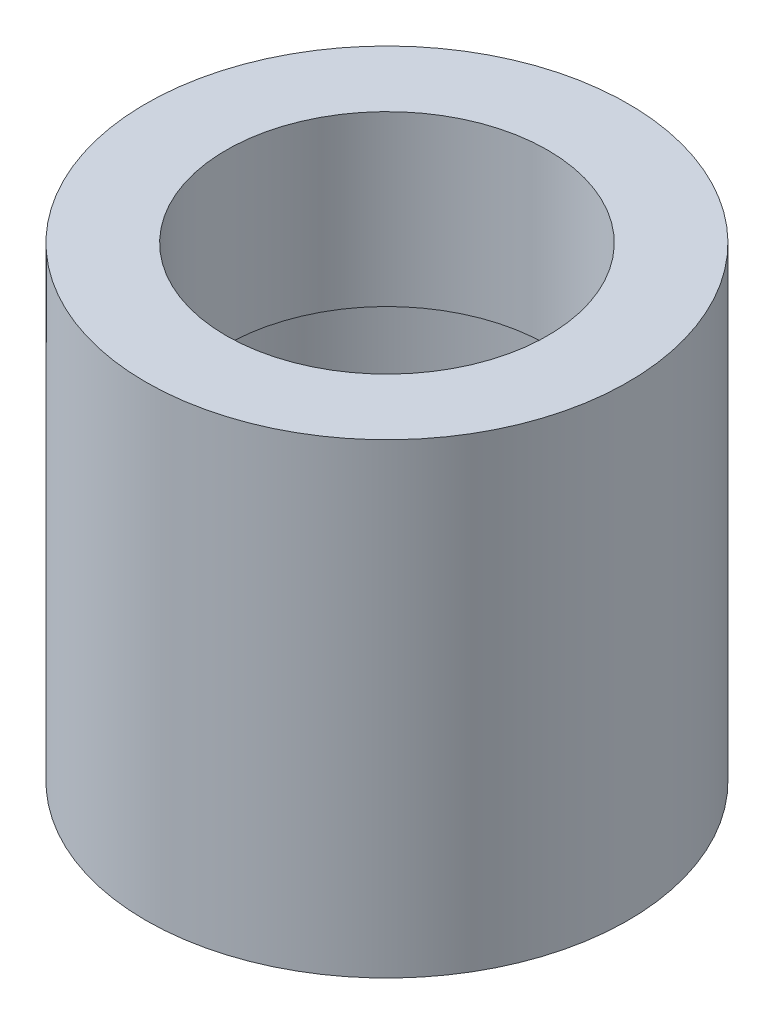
ISO-10303-21;
HEADER;
FILE_DESCRIPTION(('STEP AP214'),'2;1');
FILE_NAME('part.step','',(''),(''),'','','');
FILE_SCHEMA(('AUTOMOTIVE_DESIGN { 1 0 10303 214 1 1 1 1 }'));
ENDSEC;
DATA;
#1=APPLICATION_CONTEXT('core data for automotive mechanical design processes');
#2=APPLICATION_PROTOCOL_DEFINITION('international standard','automotive_design',2000,#1);
#3=PRODUCT_CONTEXT('',#1,'mechanical');
#4=PRODUCT('Part','Part','',(#3));
#5=PRODUCT_RELATED_PRODUCT_CATEGORY('part','',(#4));
#6=PRODUCT_DEFINITION_FORMATION('','',#4);
#7=PRODUCT_DEFINITION_CONTEXT('part definition',#1,'design');
#8=PRODUCT_DEFINITION('design','',#6,#7);
#9=PRODUCT_DEFINITION_SHAPE('','',#8);
#10=(LENGTH_UNIT() NAMED_UNIT(*) SI_UNIT(.MILLI.,.METRE.));
#11=(NAMED_UNIT(*) PLANE_ANGLE_UNIT() SI_UNIT($,.RADIAN.));
#12=(NAMED_UNIT(*) SI_UNIT($,.STERADIAN.) SOLID_ANGLE_UNIT());
#13=UNCERTAINTY_MEASURE_WITH_UNIT(LENGTH_MEASURE(1.E-05),#10,'distance_accuracy_value','');
#14=(GEOMETRIC_REPRESENTATION_CONTEXT(3) GLOBAL_UNCERTAINTY_ASSIGNED_CONTEXT((#13)) GLOBAL_UNIT_ASSIGNED_CONTEXT((#10,
#11,#12)) REPRESENTATION_CONTEXT('',''));
#15=CARTESIAN_POINT('',(0.,0.,0.));
#16=DIRECTION('',(0.,0.,1.));
#17=DIRECTION('',(1.,0.,0.));
#18=AXIS2_PLACEMENT_3D('',#15,#16,#17);
#19=CARTESIAN_POINT('',(0.,-14.5,0.));
#20=DIRECTION('',(0.,1.,0.));
#21=DIRECTION('',(0.,0.,1.));
#22=AXIS2_PLACEMENT_3D('',#19,#20,#21);
#23=CYLINDRICAL_SURFACE('',#22,13.);
#24=CARTESIAN_POINT('',(0.,-14.5,0.));
#25=DIRECTION('',(0.,1.,0.));
#26=DIRECTION('',(0.,0.,1.));
#27=AXIS2_PLACEMENT_3D('',#24,#25,#26);
#28=CIRCLE('',#27,13.);
#29=CARTESIAN_POINT('',(0.,-14.5,13.));
#30=VERTEX_POINT('',#29);
#31=EDGE_CURVE('E62',#30,#30,#28,.T.);
#32=CARTESIAN_POINT('',(0.,4.,0.));
#33=DIRECTION('',(0.,1.,0.));
#34=DIRECTION('',(0.,0.,1.));
#35=AXIS2_PLACEMENT_3D('',#32,#33,#34);
#36=CIRCLE('',#35,13.);
#37=CARTESIAN_POINT('',(0.,4.,13.));
#38=VERTEX_POINT('',#37);
#39=EDGE_CURVE('E10',#38,#38,#36,.F.);
#40=CARTESIAN_POINT('',(0.,-14.5,13.));
#41=CARTESIAN_POINT('',(0.,-14.3072916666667,13.));
#42=CARTESIAN_POINT('',(0.,-14.1145833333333,13.));
#43=CARTESIAN_POINT('',(0.,-13.7291666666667,13.));
#44=CARTESIAN_POINT('',(0.,-13.5364583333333,13.));
#45=CARTESIAN_POINT('',(0.,-13.1510416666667,13.));
#46=CARTESIAN_POINT('',(0.,-12.9583333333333,13.));
#47=CARTESIAN_POINT('',(0.,-12.5729166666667,13.));
#48=CARTESIAN_POINT('',(0.,-12.3802083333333,13.));
#49=CARTESIAN_POINT('',(0.,-11.9947916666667,13.));
#50=CARTESIAN_POINT('',(0.,-11.8020833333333,13.));
#51=CARTESIAN_POINT('',(0.,-11.4166666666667,13.));
#52=CARTESIAN_POINT('',(0.,-11.2239583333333,13.));
#53=CARTESIAN_POINT('',(0.,-10.8385416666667,13.));
#54=CARTESIAN_POINT('',(0.,-10.6458333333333,13.));
#55=CARTESIAN_POINT('',(0.,-10.2604166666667,13.));
#56=CARTESIAN_POINT('',(0.,-10.0677083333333,13.));
#57=CARTESIAN_POINT('',(0.,-9.68229166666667,13.));
#58=CARTESIAN_POINT('',(0.,-9.48958333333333,13.));
#59=CARTESIAN_POINT('',(0.,-9.10416666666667,13.));
#60=CARTESIAN_POINT('',(0.,-8.91145833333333,13.));
#61=CARTESIAN_POINT('',(0.,-8.52604166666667,13.));
#62=CARTESIAN_POINT('',(0.,-8.33333333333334,13.));
#63=CARTESIAN_POINT('',(0.,-7.94791666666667,13.));
#64=CARTESIAN_POINT('',(0.,-7.75520833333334,13.));
#65=CARTESIAN_POINT('',(0.,-7.36979166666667,13.));
#66=CARTESIAN_POINT('',(0.,-7.17708333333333,13.));
#67=CARTESIAN_POINT('',(0.,-6.79166666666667,13.));
#68=CARTESIAN_POINT('',(0.,-6.59895833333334,13.));
#69=CARTESIAN_POINT('',(0.,-6.21354166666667,13.));
#70=CARTESIAN_POINT('',(0.,-6.02083333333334,13.));
#71=CARTESIAN_POINT('',(0.,-5.63541666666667,13.));
#72=CARTESIAN_POINT('',(0.,-5.44270833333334,13.));
#73=CARTESIAN_POINT('',(0.,-5.05729166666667,13.));
#74=CARTESIAN_POINT('',(0.,-4.86458333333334,13.));
#75=CARTESIAN_POINT('',(0.,-4.47916666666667,13.));
#76=CARTESIAN_POINT('',(0.,-4.28645833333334,13.));
#77=CARTESIAN_POINT('',(0.,-3.90104166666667,13.));
#78=CARTESIAN_POINT('',(0.,-3.70833333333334,13.));
#79=CARTESIAN_POINT('',(0.,-3.32291666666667,13.));
#80=CARTESIAN_POINT('',(0.,-3.13020833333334,13.));
#81=CARTESIAN_POINT('',(0.,-2.74479166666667,13.));
#82=CARTESIAN_POINT('',(0.,-2.55208333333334,13.));
#83=CARTESIAN_POINT('',(0.,-2.16666666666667,13.));
#84=CARTESIAN_POINT('',(0.,-1.97395833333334,13.));
#85=CARTESIAN_POINT('',(0.,-1.58854166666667,13.));
#86=CARTESIAN_POINT('',(0.,-1.39583333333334,13.));
#87=CARTESIAN_POINT('',(0.,-1.01041666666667,13.));
#88=CARTESIAN_POINT('',(0.,-0.817708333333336,13.));
#89=CARTESIAN_POINT('',(0.,-0.432291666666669,13.));
#90=CARTESIAN_POINT('',(0.,-0.239583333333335,13.));
#91=CARTESIAN_POINT('',(0.,0.145833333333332,13.));
#92=CARTESIAN_POINT('',(0.,0.338541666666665,13.));
#93=CARTESIAN_POINT('',(0.,0.723958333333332,13.));
#94=CARTESIAN_POINT('',(0.,0.916666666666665,13.));
#95=CARTESIAN_POINT('',(0.,1.30208333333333,13.));
#96=CARTESIAN_POINT('',(0.,1.49479166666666,13.));
#97=CARTESIAN_POINT('',(0.,1.88020833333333,13.));
#98=CARTESIAN_POINT('',(0.,2.07291666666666,13.));
#99=CARTESIAN_POINT('',(0.,2.45833333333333,13.));
#100=CARTESIAN_POINT('',(0.,2.65104166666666,13.));
#101=CARTESIAN_POINT('',(0.,3.03645833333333,13.));
#102=CARTESIAN_POINT('',(0.,3.22916666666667,13.));
#103=CARTESIAN_POINT('',(0.,3.61458333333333,13.));
#104=CARTESIAN_POINT('',(0.,3.80729166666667,13.));
#105=CARTESIAN_POINT('',(0.,4.,13.));
#106=B_SPLINE_CURVE_WITH_KNOTS('',3,(#40,#41,#42,#43,#44,#45,#46,#47,#48,#49,#50,#51,#52,#53,
#54,#55,#56,#57,#58,#59,#60,#61,#62,#63,#64,#65,#66,#67,#68,#69,#70,#71,#72,#73,#74,#75,#76,#77,
#78,#79,#80,#81,#82,#83,#84,#85,#86,#87,#88,#89,#90,#91,#92,#93,#94,#95,#96,#97,#98,#99,#100,
#101,#102,#103,#104,#105),.UNSPECIFIED.,.F.,.F.,(4,2,2,2,2,2,2,2,2,2,2,2,2,2,2,2,2,2,2,2,2,2,2,
2,2,2,2,2,2,2,2,2,4),(0.,0.578125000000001,1.15625,1.734375,2.3125,2.890625,3.46875,4.046875,
4.625,5.203125,5.78125,6.359375,6.9375,7.515625,8.09375,8.671875,9.25,9.828125,10.40625,
10.984375,11.5625,12.140625,12.71875,13.296875,13.875,14.453125,15.03125,15.609375,16.1875,
16.765625,17.34375,17.921875,18.5),.UNSPECIFIED.);
#107=EDGE_CURVE('BSEAM43',#30,#38,#106,.T.);
#108=ORIENTED_EDGE('',*,*,#31,.F.);
#109=ORIENTED_EDGE('',*,*,#39,.F.);
#110=ORIENTED_EDGE('',*,*,#107,.T.);
#111=ORIENTED_EDGE('',*,*,#107,.F.);
#112=EDGE_LOOP('',(#108,#110,#109,#111));
#113=FACE_BOUND('',#112,.T.);
#114=ADVANCED_FACE('F43',(#113),#23,.F.);
#115=CARTESIAN_POINT('',(0.,-14.5,0.));
#116=DIRECTION('',(0.,1.,0.));
#117=DIRECTION('',(0.,0.,1.));
#118=AXIS2_PLACEMENT_3D('',#115,#116,#117);
#119=CYLINDRICAL_SURFACE('',#118,15.);
#120=CARTESIAN_POINT('',(0.,-14.5,0.));
#121=DIRECTION('',(0.,1.,0.));
#122=DIRECTION('',(0.,0.,1.));
#123=AXIS2_PLACEMENT_3D('',#120,#121,#122);
#124=CIRCLE('',#123,15.);
#125=CARTESIAN_POINT('',(0.,-14.5,15.));
#126=VERTEX_POINT('',#125);
#127=EDGE_CURVE('E51',#126,#126,#124,.T.);
#128=CARTESIAN_POINT('',(0.,14.5,0.));
#129=DIRECTION('',(0.,1.,0.));
#130=DIRECTION('',(0.,0.,1.));
#131=AXIS2_PLACEMENT_3D('',#128,#129,#130);
#132=CIRCLE('',#131,15.);
#133=CARTESIAN_POINT('',(0.,14.5,15.));
#134=VERTEX_POINT('',#133);
#135=EDGE_CURVE('E56',#134,#134,#132,.T.);
#136=CARTESIAN_POINT('',(0.,-14.5,15.));
#137=CARTESIAN_POINT('',(0.,-14.1979166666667,15.));
#138=CARTESIAN_POINT('',(0.,-13.8958333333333,15.));
#139=CARTESIAN_POINT('',(0.,-13.2916666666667,15.));
#140=CARTESIAN_POINT('',(0.,-12.9895833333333,15.));
#141=CARTESIAN_POINT('',(0.,-12.3854166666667,15.));
#142=CARTESIAN_POINT('',(0.,-12.0833333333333,15.));
#143=CARTESIAN_POINT('',(0.,-11.4791666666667,15.));
#144=CARTESIAN_POINT('',(0.,-11.1770833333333,15.));
#145=CARTESIAN_POINT('',(0.,-10.5729166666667,15.));
#146=CARTESIAN_POINT('',(0.,-10.2708333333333,15.));
#147=CARTESIAN_POINT('',(0.,-9.66666666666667,15.));
#148=CARTESIAN_POINT('',(0.,-9.36458333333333,15.));
#149=CARTESIAN_POINT('',(0.,-8.76041666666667,15.));
#150=CARTESIAN_POINT('',(0.,-8.45833333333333,15.));
#151=CARTESIAN_POINT('',(0.,-7.85416666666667,15.));
#152=CARTESIAN_POINT('',(0.,-7.55208333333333,15.));
#153=CARTESIAN_POINT('',(0.,-6.94791666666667,15.));
#154=CARTESIAN_POINT('',(0.,-6.64583333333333,15.));
#155=CARTESIAN_POINT('',(0.,-6.04166666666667,15.));
#156=CARTESIAN_POINT('',(0.,-5.73958333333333,15.));
#157=CARTESIAN_POINT('',(0.,-5.13541666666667,15.));
#158=CARTESIAN_POINT('',(0.,-4.83333333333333,15.));
#159=CARTESIAN_POINT('',(0.,-4.22916666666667,15.));
#160=CARTESIAN_POINT('',(0.,-3.92708333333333,15.));
#161=CARTESIAN_POINT('',(0.,-3.32291666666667,15.));
#162=CARTESIAN_POINT('',(0.,-3.02083333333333,15.));
#163=CARTESIAN_POINT('',(0.,-2.41666666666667,15.));
#164=CARTESIAN_POINT('',(0.,-2.11458333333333,15.));
#165=CARTESIAN_POINT('',(0.,-1.51041666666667,15.));
#166=CARTESIAN_POINT('',(0.,-1.20833333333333,15.));
#167=CARTESIAN_POINT('',(0.,-0.604166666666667,15.));
#168=CARTESIAN_POINT('',(0.,-0.302083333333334,15.));
#169=CARTESIAN_POINT('',(0.,0.302083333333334,15.));
#170=CARTESIAN_POINT('',(0.,0.604166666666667,15.));
#171=CARTESIAN_POINT('',(0.,1.20833333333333,15.));
#172=CARTESIAN_POINT('',(0.,1.51041666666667,15.));
#173=CARTESIAN_POINT('',(0.,2.11458333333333,15.));
#174=CARTESIAN_POINT('',(0.,2.41666666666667,15.));
#175=CARTESIAN_POINT('',(0.,3.02083333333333,15.));
#176=CARTESIAN_POINT('',(0.,3.32291666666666,15.));
#177=CARTESIAN_POINT('',(0.,3.92708333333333,15.));
#178=CARTESIAN_POINT('',(0.,4.22916666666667,15.));
#179=CARTESIAN_POINT('',(0.,4.83333333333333,15.));
#180=CARTESIAN_POINT('',(0.,5.13541666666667,15.));
#181=CARTESIAN_POINT('',(0.,5.73958333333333,15.));
#182=CARTESIAN_POINT('',(0.,6.04166666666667,15.));
#183=CARTESIAN_POINT('',(0.,6.64583333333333,15.));
#184=CARTESIAN_POINT('',(0.,6.94791666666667,15.));
#185=CARTESIAN_POINT('',(0.,7.55208333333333,15.));
#186=CARTESIAN_POINT('',(0.,7.85416666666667,15.));
#187=CARTESIAN_POINT('',(0.,8.45833333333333,15.));
#188=CARTESIAN_POINT('',(0.,8.76041666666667,15.));
#189=CARTESIAN_POINT('',(0.,9.36458333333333,15.));
#190=CARTESIAN_POINT('',(0.,9.66666666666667,15.));
#191=CARTESIAN_POINT('',(0.,10.2708333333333,15.));
#192=CARTESIAN_POINT('',(0.,10.5729166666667,15.));
#193=CARTESIAN_POINT('',(0.,11.1770833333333,15.));
#194=CARTESIAN_POINT('',(0.,11.4791666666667,15.));
#195=CARTESIAN_POINT('',(0.,12.0833333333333,15.));
#196=CARTESIAN_POINT('',(0.,12.3854166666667,15.));
#197=CARTESIAN_POINT('',(0.,12.9895833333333,15.));
#198=CARTESIAN_POINT('',(0.,13.2916666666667,15.));
#199=CARTESIAN_POINT('',(0.,13.8958333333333,15.));
#200=CARTESIAN_POINT('',(0.,14.1979166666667,15.));
#201=CARTESIAN_POINT('',(0.,14.5,15.));
#202=B_SPLINE_CURVE_WITH_KNOTS('',3,(#136,#137,#138,#139,#140,#141,#142,#143,#144,#145,#146,
#147,#148,#149,#150,#151,#152,#153,#154,#155,#156,#157,#158,#159,#160,#161,#162,#163,#164,#165,
#166,#167,#168,#169,#170,#171,#172,#173,#174,#175,#176,#177,#178,#179,#180,#181,#182,#183,#184,
#185,#186,#187,#188,#189,#190,#191,#192,#193,#194,#195,#196,#197,#198,#199,#200,#201),
.UNSPECIFIED.,.F.,.F.,(4,2,2,2,2,2,2,2,2,2,2,2,2,2,2,2,2,2,2,2,2,2,2,2,2,2,2,2,2,2,2,2,4),(0.,
0.906249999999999,1.8125,2.71875,3.625,4.53125,5.4375,6.34375,7.25,8.15625,9.0625,9.96875,
10.875,11.78125,12.6875,13.59375,14.5,15.40625,16.3125,17.21875,18.125,19.03125,19.9375,
20.84375,21.75,22.65625,23.5625,24.46875,25.375,26.28125,27.1875,28.09375,29.),.UNSPECIFIED.);
#203=EDGE_CURVE('BSEAM45',#126,#134,#202,.T.);
#204=ORIENTED_EDGE('',*,*,#127,.T.);
#205=ORIENTED_EDGE('',*,*,#135,.F.);
#206=ORIENTED_EDGE('',*,*,#203,.T.);
#207=ORIENTED_EDGE('',*,*,#203,.F.);
#208=EDGE_LOOP('',(#204,#206,#205,#207));
#209=FACE_BOUND('',#208,.T.);
#210=ADVANCED_FACE('F45',(#209),#119,.T.);
#211=CARTESIAN_POINT('',(0.,-14.5,0.));
#212=DIRECTION('',(0.,1.,0.));
#213=DIRECTION('',(0.,0.,1.));
#214=AXIS2_PLACEMENT_3D('',#211,#212,#213);
#215=PLANE('',#214);
#216=ORIENTED_EDGE('',*,*,#31,.T.);
#217=EDGE_LOOP('',(#216));
#218=FACE_BOUND('',#217,.T.);
#219=ORIENTED_EDGE('',*,*,#127,.F.);
#220=EDGE_LOOP('',(#219));
#221=FACE_BOUND('',#220,.T.);
#222=ADVANCED_FACE('F86',(#218,#221),#215,.F.);
#223=CARTESIAN_POINT('',(0.,14.5,0.));
#224=DIRECTION('',(0.,1.,0.));
#225=DIRECTION('',(0.,0.,1.));
#226=AXIS2_PLACEMENT_3D('',#223,#224,#225);
#227=PLANE('',#226);
#228=ORIENTED_EDGE('',*,*,#135,.T.);
#229=EDGE_LOOP('',(#228));
#230=FACE_BOUND('',#229,.T.);
#231=CARTESIAN_POINT('',(0.,14.5,0.));
#232=DIRECTION('',(0.,1.,0.));
#233=DIRECTION('',(0.,0.,1.));
#234=AXIS2_PLACEMENT_3D('',#231,#232,#233);
#235=CIRCLE('',#234,10.);
#236=CARTESIAN_POINT('',(0.,14.5,10.));
#237=VERTEX_POINT('',#236);
#238=EDGE_CURVE('E68',#237,#237,#235,.T.);
#239=ORIENTED_EDGE('',*,*,#238,.F.);
#240=EDGE_LOOP('',(#239));
#241=FACE_BOUND('',#240,.T.);
#242=ADVANCED_FACE('F84',(#230,#241),#227,.T.);
#243=CARTESIAN_POINT('',(0.,4.,0.));
#244=DIRECTION('',(0.,1.,0.));
#245=DIRECTION('',(0.,0.,1.));
#246=AXIS2_PLACEMENT_3D('',#243,#244,#245);
#247=PLANE('',#246);
#248=CARTESIAN_POINT('',(0.,4.,0.));
#249=DIRECTION('',(0.,1.,0.));
#250=DIRECTION('',(0.,0.,1.));
#251=AXIS2_PLACEMENT_3D('',#248,#249,#250);
#252=CIRCLE('',#251,10.);
#253=CARTESIAN_POINT('',(0.,4.,10.));
#254=VERTEX_POINT('',#253);
#255=EDGE_CURVE('E67',#254,#254,#252,.T.);
#256=ORIENTED_EDGE('',*,*,#255,.T.);
#257=EDGE_LOOP('',(#256));
#258=FACE_BOUND('',#257,.T.);
#259=ORIENTED_EDGE('',*,*,#39,.T.);
#260=EDGE_LOOP('',(#259));
#261=FACE_BOUND('',#260,.T.);
#262=ADVANCED_FACE('F76',(#258,#261),#247,.F.);
#263=CARTESIAN_POINT('',(0.,4.,0.));
#264=DIRECTION('',(0.,1.,0.));
#265=DIRECTION('',(0.,0.,1.));
#266=AXIS2_PLACEMENT_3D('',#263,#264,#265);
#267=CYLINDRICAL_SURFACE('',#266,10.);
#268=CARTESIAN_POINT('',(0.,4.,10.));
#269=CARTESIAN_POINT('',(0.,4.109375,10.));
#270=CARTESIAN_POINT('',(0.,4.21875,10.));
#271=CARTESIAN_POINT('',(0.,4.4375,10.));
#272=CARTESIAN_POINT('',(0.,4.546875,10.));
#273=CARTESIAN_POINT('',(0.,4.765625,10.));
#274=CARTESIAN_POINT('',(0.,4.875,10.));
#275=CARTESIAN_POINT('',(0.,5.09375,10.));
#276=CARTESIAN_POINT('',(0.,5.203125,10.));
#277=CARTESIAN_POINT('',(0.,5.421875,10.));
#278=CARTESIAN_POINT('',(0.,5.53125,10.));
#279=CARTESIAN_POINT('',(0.,5.75,10.));
#280=CARTESIAN_POINT('',(0.,5.859375,10.));
#281=CARTESIAN_POINT('',(0.,6.078125,10.));
#282=CARTESIAN_POINT('',(0.,6.1875,10.));
#283=CARTESIAN_POINT('',(0.,6.40625,10.));
#284=CARTESIAN_POINT('',(0.,6.515625,10.));
#285=CARTESIAN_POINT('',(0.,6.734375,10.));
#286=CARTESIAN_POINT('',(0.,6.84375,10.));
#287=CARTESIAN_POINT('',(0.,7.0625,10.));
#288=CARTESIAN_POINT('',(0.,7.171875,10.));
#289=CARTESIAN_POINT('',(0.,7.390625,10.));
#290=CARTESIAN_POINT('',(0.,7.5,10.));
#291=CARTESIAN_POINT('',(0.,7.71875,10.));
#292=CARTESIAN_POINT('',(0.,7.828125,10.));
#293=CARTESIAN_POINT('',(0.,8.046875,10.));
#294=CARTESIAN_POINT('',(0.,8.15625,10.));
#295=CARTESIAN_POINT('',(0.,8.375,10.));
#296=CARTESIAN_POINT('',(0.,8.484375,10.));
#297=CARTESIAN_POINT('',(0.,8.703125,10.));
#298=CARTESIAN_POINT('',(0.,8.8125,10.));
#299=CARTESIAN_POINT('',(0.,9.03125,10.));
#300=CARTESIAN_POINT('',(0.,9.140625,10.));
#301=CARTESIAN_POINT('',(0.,9.359375,10.));
#302=CARTESIAN_POINT('',(0.,9.46875,10.));
#303=CARTESIAN_POINT('',(0.,9.6875,10.));
#304=CARTESIAN_POINT('',(0.,9.796875,10.));
#305=CARTESIAN_POINT('',(0.,10.015625,10.));
#306=CARTESIAN_POINT('',(0.,10.125,10.));
#307=CARTESIAN_POINT('',(0.,10.34375,10.));
#308=CARTESIAN_POINT('',(0.,10.453125,10.));
#309=CARTESIAN_POINT('',(0.,10.671875,10.));
#310=CARTESIAN_POINT('',(0.,10.78125,10.));
#311=CARTESIAN_POINT('',(0.,11.,10.));
#312=CARTESIAN_POINT('',(0.,11.109375,10.));
#313=CARTESIAN_POINT('',(0.,11.328125,10.));
#314=CARTESIAN_POINT('',(0.,11.4375,10.));
#315=CARTESIAN_POINT('',(0.,11.65625,10.));
#316=CARTESIAN_POINT('',(0.,11.765625,10.));
#317=CARTESIAN_POINT('',(0.,11.984375,10.));
#318=CARTESIAN_POINT('',(0.,12.09375,10.));
#319=CARTESIAN_POINT('',(0.,12.3125,10.));
#320=CARTESIAN_POINT('',(0.,12.421875,10.));
#321=CARTESIAN_POINT('',(0.,12.640625,10.));
#322=CARTESIAN_POINT('',(0.,12.75,10.));
#323=CARTESIAN_POINT('',(0.,12.96875,10.));
#324=CARTESIAN_POINT('',(0.,13.078125,10.));
#325=CARTESIAN_POINT('',(0.,13.296875,10.));
#326=CARTESIAN_POINT('',(0.,13.40625,10.));
#327=CARTESIAN_POINT('',(0.,13.625,10.));
#328=CARTESIAN_POINT('',(0.,13.734375,10.));
#329=CARTESIAN_POINT('',(0.,13.953125,10.));
#330=CARTESIAN_POINT('',(0.,14.0625,10.));
#331=CARTESIAN_POINT('',(0.,14.28125,10.));
#332=CARTESIAN_POINT('',(0.,14.390625,10.));
#333=CARTESIAN_POINT('',(0.,14.5,10.));
#334=B_SPLINE_CURVE_WITH_KNOTS('',3,(#268,#269,#270,#271,#272,#273,#274,#275,#276,#277,#278,
#279,#280,#281,#282,#283,#284,#285,#286,#287,#288,#289,#290,#291,#292,#293,#294,#295,#296,#297,
#298,#299,#300,#301,#302,#303,#304,#305,#306,#307,#308,#309,#310,#311,#312,#313,#314,#315,#316,
#317,#318,#319,#320,#321,#322,#323,#324,#325,#326,#327,#328,#329,#330,#331,#332,#333),
.UNSPECIFIED.,.F.,.F.,(4,2,2,2,2,2,2,2,2,2,2,2,2,2,2,2,2,2,2,2,2,2,2,2,2,2,2,2,2,2,2,2,4),(0.,
0.328125,0.656250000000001,0.984375,1.3125,1.640625,1.96875,2.296875,2.625,2.953125,3.28125,
3.609375,3.9375,4.265625,4.59375,4.921875,5.25,5.578125,5.90625,6.234375,6.5625,6.890625,
7.21875,7.546875,7.875,8.203125,8.53125,8.859375,9.1875,9.515625,9.84375,10.171875,10.5),.UNSPECIFIED.);
#335=EDGE_CURVE('BSEAM78',#254,#237,#334,.T.);
#336=ORIENTED_EDGE('',*,*,#255,.F.);
#337=ORIENTED_EDGE('',*,*,#238,.T.);
#338=ORIENTED_EDGE('',*,*,#335,.T.);
#339=ORIENTED_EDGE('',*,*,#335,.F.);
#340=EDGE_LOOP('',(#336,#338,#337,#339));
#341=FACE_BOUND('',#340,.T.);
#342=ADVANCED_FACE('F78',(#341),#267,.F.);
#343=CLOSED_SHELL('',(#114,#210,#222,#242,#262,#342));
#344=MANIFOLD_SOLID_BREP('B2',#343);
#345=ADVANCED_BREP_SHAPE_REPRESENTATION('',(#18,#344),#14);
#346=SHAPE_DEFINITION_REPRESENTATION(#9,#345);
ENDSEC;
END-ISO-10303-21;
